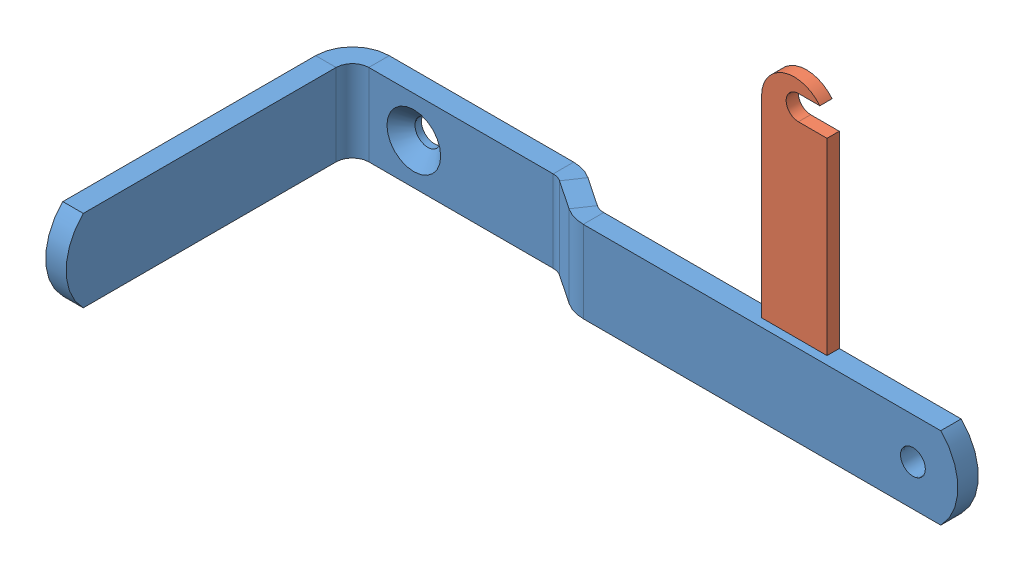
SolidWorks assembly Patin de frein droit.SLDASM, configuration Défaut (file format 7000). Lengths in mm.
Overall size (160 75 75).
2 component instances, 2 part files, 3 mates.
Components (placement in the parent):
- Patin de frein-1: Patin de frein.SLDPRT [Défaut] at origin size (160 20 75)
- Attache ressort de frein-1: Attache ressort de frein.SLDPRT [Défaut] at (113 10 -68) size (16 55 3)
Mates (geometry in assembly coordinates):
- Coïncidente1: coincident aligned: plane of Patin de frein-1 through (-1.9055 0 -68) normal (0 0 -1); plane of Attache ressort de frein-1 through (114 59 -68) normal (0 0 -1)
- Coïncidente2: coincident anti-aligned: plane of Patin de frein-1 through (153.0945 10 -68) normal (0 1 0); plane of Attache ressort de frein-1 through (105 10 -65) normal (0 -1 0)
- Distance1: distance = 110 mm aligned: plane of Attache ressort de frein-1 through (105 57 -65) normal (-1 0 0); plane of Patin de frein-1 through (-5 0 0) normal (-1 0 0)
